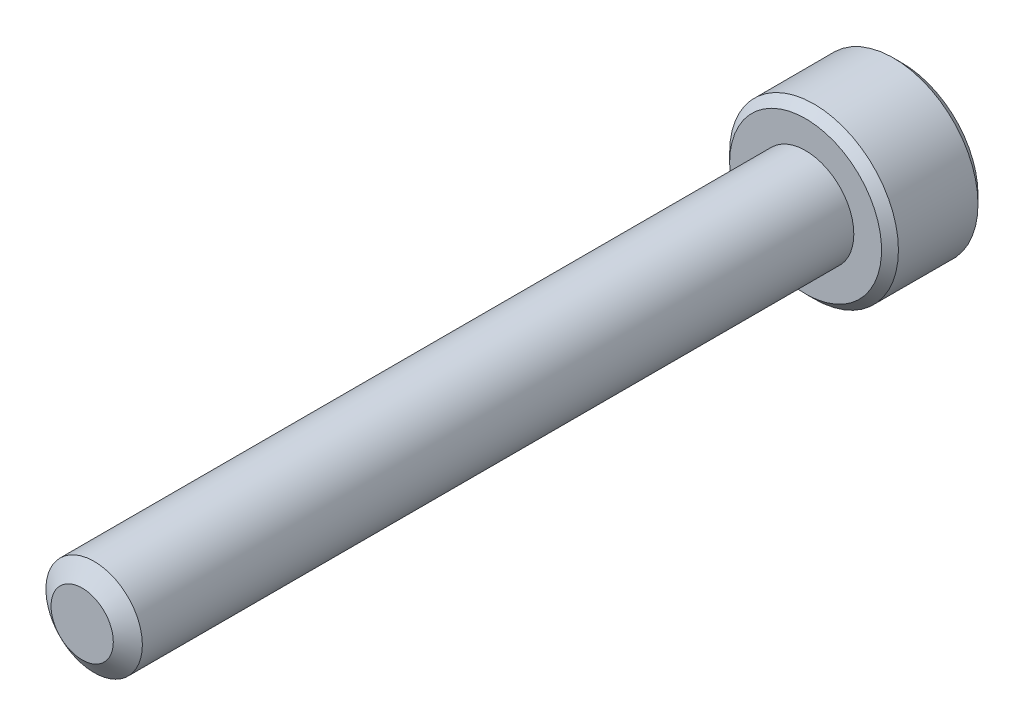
ISO-10303-21;
HEADER;
FILE_DESCRIPTION(('STEP AP214'),'2;1');
FILE_NAME('part.step','',(''),(''),'','','');
FILE_SCHEMA(('AUTOMOTIVE_DESIGN { 1 0 10303 214 1 1 1 1 }'));
ENDSEC;
DATA;
#1=APPLICATION_CONTEXT('core data for automotive mechanical design processes');
#2=APPLICATION_PROTOCOL_DEFINITION('international standard','automotive_design',2000,#1);
#3=PRODUCT_CONTEXT('',#1,'mechanical');
#4=PRODUCT('Part','Part','',(#3));
#5=PRODUCT_RELATED_PRODUCT_CATEGORY('part','',(#4));
#6=PRODUCT_DEFINITION_FORMATION('','',#4);
#7=PRODUCT_DEFINITION_CONTEXT('part definition',#1,'design');
#8=PRODUCT_DEFINITION('design','',#6,#7);
#9=PRODUCT_DEFINITION_SHAPE('','',#8);
#10=(LENGTH_UNIT() NAMED_UNIT(*) SI_UNIT(.MILLI.,.METRE.));
#11=(NAMED_UNIT(*) PLANE_ANGLE_UNIT() SI_UNIT($,.RADIAN.));
#12=(NAMED_UNIT(*) SI_UNIT($,.STERADIAN.) SOLID_ANGLE_UNIT());
#13=UNCERTAINTY_MEASURE_WITH_UNIT(LENGTH_MEASURE(1.E-05),#10,'distance_accuracy_value','');
#14=(GEOMETRIC_REPRESENTATION_CONTEXT(3) GLOBAL_UNCERTAINTY_ASSIGNED_CONTEXT((#13)) GLOBAL_UNIT_ASSIGNED_CONTEXT((#10,
#11,#12)) REPRESENTATION_CONTEXT('',''));
#15=CARTESIAN_POINT('',(0.,0.,0.));
#16=DIRECTION('',(0.,0.,1.));
#17=DIRECTION('',(1.,0.,0.));
#18=AXIS2_PLACEMENT_3D('',#15,#16,#17);
#19=CARTESIAN_POINT('',(0.,0.,-30.));
#20=DIRECTION('',(0.,0.,0.999999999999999));
#21=DIRECTION('',(1.,0.,0.));
#22=AXIS2_PLACEMENT_3D('',#19,#20,#21);
#23=CYLINDRICAL_SURFACE('',#22,2.);
#24=CARTESIAN_POINT('',(0.,0.,-0.496211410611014));
#25=DIRECTION('',(0.,0.,0.999999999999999));
#26=DIRECTION('',(1.,0.,0.));
#27=AXIS2_PLACEMENT_3D('',#24,#25,#26);
#28=CIRCLE('',#27,2.);
#29=CARTESIAN_POINT('',(2.,0.,-0.496211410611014));
#30=VERTEX_POINT('',#29);
#31=EDGE_CURVE('E110',#30,#30,#28,.T.);
#32=CARTESIAN_POINT('',(0.,0.,-30.));
#33=DIRECTION('',(0.,0.,-0.999999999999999));
#34=DIRECTION('',(-1.,0.,0.));
#35=AXIS2_PLACEMENT_3D('',#32,#33,#34);
#36=CIRCLE('',#35,2.);
#37=CARTESIAN_POINT('',(2.,0.,-30.));
#38=VERTEX_POINT('',#37);
#39=EDGE_CURVE('E213',#38,#38,#36,.F.);
#40=CARTESIAN_POINT('',(2.,0.,-0.496211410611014));
#41=CARTESIAN_POINT('',(2.,0.,-0.803542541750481));
#42=CARTESIAN_POINT('',(2.,0.,-1.11087367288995));
#43=CARTESIAN_POINT('',(2.,0.,-1.72553593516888));
#44=CARTESIAN_POINT('',(2.,0.,-2.03286706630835));
#45=CARTESIAN_POINT('',(2.,0.,-2.64752932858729));
#46=CARTESIAN_POINT('',(2.,0.,-2.95486045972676));
#47=CARTESIAN_POINT('',(2.,0.,-3.56952272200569));
#48=CARTESIAN_POINT('',(2.,0.,-3.87685385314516));
#49=CARTESIAN_POINT('',(2.,0.,-4.4915161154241));
#50=CARTESIAN_POINT('',(2.,0.,-4.79884724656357));
#51=CARTESIAN_POINT('',(2.,0.,-5.41350950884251));
#52=CARTESIAN_POINT('',(2.,0.,-5.72084063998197));
#53=CARTESIAN_POINT('',(2.,0.,-6.33550290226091));
#54=CARTESIAN_POINT('',(2.,0.,-6.64283403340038));
#55=CARTESIAN_POINT('',(2.,0.,-7.25749629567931));
#56=CARTESIAN_POINT('',(2.,0.,-7.56482742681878));
#57=CARTESIAN_POINT('',(2.,0.,-8.17948968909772));
#58=CARTESIAN_POINT('',(2.,0.,-8.48682082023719));
#59=CARTESIAN_POINT('',(2.,0.,-9.10148308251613));
#60=CARTESIAN_POINT('',(2.,0.,-9.40881421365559));
#61=CARTESIAN_POINT('',(2.,0.,-10.0234764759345));
#62=CARTESIAN_POINT('',(2.,0.,-10.330807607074));
#63=CARTESIAN_POINT('',(2.,0.,-10.9454698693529));
#64=CARTESIAN_POINT('',(2.,0.,-11.2528010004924));
#65=CARTESIAN_POINT('',(2.,0.,-11.8674632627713));
#66=CARTESIAN_POINT('',(2.,0.,-12.1747943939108));
#67=CARTESIAN_POINT('',(2.,0.,-12.7894566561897));
#68=CARTESIAN_POINT('',(2.,0.,-13.0967877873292));
#69=CARTESIAN_POINT('',(2.,0.,-13.7114500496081));
#70=CARTESIAN_POINT('',(2.,0.,-14.0187811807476));
#71=CARTESIAN_POINT('',(2.,0.,-14.6334434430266));
#72=CARTESIAN_POINT('',(2.,0.,-14.940774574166));
#73=CARTESIAN_POINT('',(2.,0.,-15.555436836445));
#74=CARTESIAN_POINT('',(2.,0.,-15.8627679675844));
#75=CARTESIAN_POINT('',(2.,0.,-16.4774302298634));
#76=CARTESIAN_POINT('',(2.,0.,-16.7847613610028));
#77=CARTESIAN_POINT('',(2.,0.,-17.3994236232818));
#78=CARTESIAN_POINT('',(2.,0.,-17.7067547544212));
#79=CARTESIAN_POINT('',(2.,0.,-18.3214170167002));
#80=CARTESIAN_POINT('',(2.,0.,-18.6287481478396));
#81=CARTESIAN_POINT('',(2.,0.,-19.2434104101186));
#82=CARTESIAN_POINT('',(2.,0.,-19.550741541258));
#83=CARTESIAN_POINT('',(2.,0.,-20.165403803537));
#84=CARTESIAN_POINT('',(2.,0.,-20.4727349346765));
#85=CARTESIAN_POINT('',(2.,0.,-21.0873971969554));
#86=CARTESIAN_POINT('',(2.,0.,-21.3947283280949));
#87=CARTESIAN_POINT('',(2.,0.,-22.0093905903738));
#88=CARTESIAN_POINT('',(2.,0.,-22.3167217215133));
#89=CARTESIAN_POINT('',(2.,0.,-22.9313839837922));
#90=CARTESIAN_POINT('',(2.,0.,-23.2387151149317));
#91=CARTESIAN_POINT('',(2.,0.,-23.8533773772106));
#92=CARTESIAN_POINT('',(2.,0.,-24.1607085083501));
#93=CARTESIAN_POINT('',(2.,0.,-24.775370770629));
#94=CARTESIAN_POINT('',(2.,0.,-25.0827019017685));
#95=CARTESIAN_POINT('',(2.,0.,-25.6973641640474));
#96=CARTESIAN_POINT('',(2.,0.,-26.0046952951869));
#97=CARTESIAN_POINT('',(2.,0.,-26.6193575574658));
#98=CARTESIAN_POINT('',(2.,0.,-26.9266886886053));
#99=CARTESIAN_POINT('',(2.,0.,-27.5413509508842));
#100=CARTESIAN_POINT('',(2.,0.,-27.8486820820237));
#101=CARTESIAN_POINT('',(2.,0.,-28.4633443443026));
#102=CARTESIAN_POINT('',(2.,0.,-28.7706754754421));
#103=CARTESIAN_POINT('',(2.,0.,-29.385337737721));
#104=CARTESIAN_POINT('',(2.,0.,-29.6926688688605));
#105=CARTESIAN_POINT('',(2.,0.,-30.));
#106=B_SPLINE_CURVE_WITH_KNOTS('',3,(#40,#41,#42,#43,#44,#45,#46,#47,#48,#49,#50,#51,#52,#53,
#54,#55,#56,#57,#58,#59,#60,#61,#62,#63,#64,#65,#66,#67,#68,#69,#70,#71,#72,#73,#74,#75,#76,#77,
#78,#79,#80,#81,#82,#83,#84,#85,#86,#87,#88,#89,#90,#91,#92,#93,#94,#95,#96,#97,#98,#99,#100,
#101,#102,#103,#104,#105),.UNSPECIFIED.,.F.,.F.,(4,2,2,2,2,2,2,2,2,2,2,2,2,2,2,2,2,2,2,2,2,2,2,
2,2,2,2,2,2,2,2,2,4),(0.,0.921993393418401,1.84398678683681,2.76598018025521,3.68797357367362,
4.60996696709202,5.53196036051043,6.45395375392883,7.37594714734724,8.29794054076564,
9.21993393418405,10.1419273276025,11.0639207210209,11.9859141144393,12.9079075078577,
13.8299009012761,14.7518942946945,15.6738876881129,16.5958810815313,17.5178744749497,
18.4398678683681,19.3618612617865,20.2838546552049,21.2058480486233,22.1278414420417,
23.0498348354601,23.9718282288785,24.8938216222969,25.8158150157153,26.7378084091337,
27.6598018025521,28.5817951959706,29.503788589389),.UNSPECIFIED.);
#107=EDGE_CURVE('BSEAM36',#30,#38,#106,.T.);
#108=ORIENTED_EDGE('',*,*,#31,.F.);
#109=ORIENTED_EDGE('',*,*,#39,.T.);
#110=ORIENTED_EDGE('',*,*,#107,.T.);
#111=ORIENTED_EDGE('',*,*,#107,.F.);
#112=EDGE_LOOP('',(#108,#110,#109,#111));
#113=FACE_BOUND('',#112,.T.);
#114=ADVANCED_FACE('F36',(#113),#23,.T.);
#115=CARTESIAN_POINT('',(0.,0.,0.));
#116=DIRECTION('',(0.,0.,-0.999999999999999));
#117=DIRECTION('',(-1.,0.,0.));
#118=AXIS2_PLACEMENT_3D('',#115,#116,#117);
#119=CONICAL_SURFACE('',#118,1.29133666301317,0.959931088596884);
#120=ORIENTED_EDGE('',*,*,#31,.T.);
#121=EDGE_LOOP('',(#120));
#122=FACE_BOUND('',#121,.T.);
#123=CARTESIAN_POINT('',(0.,0.,0.));
#124=DIRECTION('',(0.,0.,0.999999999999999));
#125=DIRECTION('',(1.,0.,0.));
#126=AXIS2_PLACEMENT_3D('',#123,#124,#125);
#127=CIRCLE('',#126,1.29133666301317);
#128=CARTESIAN_POINT('',(1.29133666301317,0.,0.));
#129=VERTEX_POINT('',#128);
#130=EDGE_CURVE('E211',#129,#129,#127,.T.);
#131=ORIENTED_EDGE('',*,*,#130,.F.);
#132=EDGE_LOOP('',(#131));
#133=FACE_BOUND('',#132,.T.);
#134=ADVANCED_FACE('F194',(#122,#133),#119,.T.);
#135=CARTESIAN_POINT('',(0.,0.,0.));
#136=DIRECTION('',(0.,0.,0.999999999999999));
#137=DIRECTION('',(1.,0.,0.));
#138=AXIS2_PLACEMENT_3D('',#135,#136,#137);
#139=PLANE('',#138);
#140=ORIENTED_EDGE('',*,*,#130,.T.);
#141=EDGE_LOOP('',(#140));
#142=FACE_BOUND('',#141,.T.);
#143=ADVANCED_FACE('F191',(#142),#139,.T.);
#144=CARTESIAN_POINT('',(0.,0.,-34.));
#145=DIRECTION('',(0.,0.,0.999999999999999));
#146=DIRECTION('',(1.,0.,0.));
#147=AXIS2_PLACEMENT_3D('',#144,#145,#146);
#148=CYLINDRICAL_SURFACE('',#147,3.5);
#149=CARTESIAN_POINT('',(0.,0.,-33.65));
#150=DIRECTION('',(0.,0.,-0.999999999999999));
#151=DIRECTION('',(-1.,0.,0.));
#152=AXIS2_PLACEMENT_3D('',#149,#150,#151);
#153=CIRCLE('',#152,3.5);
#154=CARTESIAN_POINT('',(3.5,0.,-33.65));
#155=VERTEX_POINT('',#154);
#156=EDGE_CURVE('E44',#155,#155,#153,.F.);
#157=CARTESIAN_POINT('',(0.,0.,-30.35));
#158=DIRECTION('',(0.,0.,-0.999999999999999));
#159=DIRECTION('',(-1.,0.,0.));
#160=AXIS2_PLACEMENT_3D('',#157,#158,#159);
#161=CIRCLE('',#160,3.5);
#162=CARTESIAN_POINT('',(3.5,0.,-30.35));
#163=VERTEX_POINT('',#162);
#164=EDGE_CURVE('E170',#163,#163,#161,.T.);
#165=CARTESIAN_POINT('',(3.5,0.,-33.65));
#166=CARTESIAN_POINT('',(3.5,0.,-33.615625));
#167=CARTESIAN_POINT('',(3.5,0.,-33.58125));
#168=CARTESIAN_POINT('',(3.5,0.,-33.5125));
#169=CARTESIAN_POINT('',(3.5,0.,-33.478125));
#170=CARTESIAN_POINT('',(3.5,0.,-33.409375));
#171=CARTESIAN_POINT('',(3.5,0.,-33.375));
#172=CARTESIAN_POINT('',(3.5,0.,-33.30625));
#173=CARTESIAN_POINT('',(3.5,0.,-33.271875));
#174=CARTESIAN_POINT('',(3.5,0.,-33.203125));
#175=CARTESIAN_POINT('',(3.5,0.,-33.16875));
#176=CARTESIAN_POINT('',(3.5,0.,-33.1));
#177=CARTESIAN_POINT('',(3.5,0.,-33.065625));
#178=CARTESIAN_POINT('',(3.5,0.,-32.996875));
#179=CARTESIAN_POINT('',(3.5,0.,-32.9625));
#180=CARTESIAN_POINT('',(3.5,0.,-32.89375));
#181=CARTESIAN_POINT('',(3.5,0.,-32.859375));
#182=CARTESIAN_POINT('',(3.5,0.,-32.790625));
#183=CARTESIAN_POINT('',(3.5,0.,-32.75625));
#184=CARTESIAN_POINT('',(3.5,0.,-32.6875));
#185=CARTESIAN_POINT('',(3.5,0.,-32.653125));
#186=CARTESIAN_POINT('',(3.5,0.,-32.584375));
#187=CARTESIAN_POINT('',(3.5,0.,-32.55));
#188=CARTESIAN_POINT('',(3.5,0.,-32.48125));
#189=CARTESIAN_POINT('',(3.5,0.,-32.446875));
#190=CARTESIAN_POINT('',(3.5,0.,-32.378125));
#191=CARTESIAN_POINT('',(3.5,0.,-32.34375));
#192=CARTESIAN_POINT('',(3.5,0.,-32.275));
#193=CARTESIAN_POINT('',(3.5,0.,-32.240625));
#194=CARTESIAN_POINT('',(3.5,0.,-32.171875));
#195=CARTESIAN_POINT('',(3.5,0.,-32.1375));
#196=CARTESIAN_POINT('',(3.5,0.,-32.06875));
#197=CARTESIAN_POINT('',(3.5,0.,-32.034375));
#198=CARTESIAN_POINT('',(3.5,0.,-31.965625));
#199=CARTESIAN_POINT('',(3.5,0.,-31.93125));
#200=CARTESIAN_POINT('',(3.5,0.,-31.8625));
#201=CARTESIAN_POINT('',(3.5,0.,-31.828125));
#202=CARTESIAN_POINT('',(3.5,0.,-31.759375));
#203=CARTESIAN_POINT('',(3.5,0.,-31.725));
#204=CARTESIAN_POINT('',(3.5,0.,-31.65625));
#205=CARTESIAN_POINT('',(3.5,0.,-31.621875));
#206=CARTESIAN_POINT('',(3.5,0.,-31.553125));
#207=CARTESIAN_POINT('',(3.5,0.,-31.51875));
#208=CARTESIAN_POINT('',(3.5,0.,-31.45));
#209=CARTESIAN_POINT('',(3.5,0.,-31.415625));
#210=CARTESIAN_POINT('',(3.5,0.,-31.346875));
#211=CARTESIAN_POINT('',(3.5,0.,-31.3125));
#212=CARTESIAN_POINT('',(3.5,0.,-31.24375));
#213=CARTESIAN_POINT('',(3.5,0.,-31.209375));
#214=CARTESIAN_POINT('',(3.5,0.,-31.140625));
#215=CARTESIAN_POINT('',(3.5,0.,-31.10625));
#216=CARTESIAN_POINT('',(3.5,0.,-31.0375));
#217=CARTESIAN_POINT('',(3.5,0.,-31.003125));
#218=CARTESIAN_POINT('',(3.5,0.,-30.934375));
#219=CARTESIAN_POINT('',(3.5,0.,-30.9));
#220=CARTESIAN_POINT('',(3.5,0.,-30.83125));
#221=CARTESIAN_POINT('',(3.5,0.,-30.796875));
#222=CARTESIAN_POINT('',(3.5,0.,-30.728125));
#223=CARTESIAN_POINT('',(3.5,0.,-30.69375));
#224=CARTESIAN_POINT('',(3.5,0.,-30.625));
#225=CARTESIAN_POINT('',(3.5,0.,-30.590625));
#226=CARTESIAN_POINT('',(3.5,0.,-30.521875));
#227=CARTESIAN_POINT('',(3.5,0.,-30.4875));
#228=CARTESIAN_POINT('',(3.5,0.,-30.41875));
#229=CARTESIAN_POINT('',(3.5,0.,-30.384375));
#230=CARTESIAN_POINT('',(3.5,0.,-30.35));
#231=B_SPLINE_CURVE_WITH_KNOTS('',3,(#165,#166,#167,#168,#169,#170,#171,#172,#173,#174,#175,
#176,#177,#178,#179,#180,#181,#182,#183,#184,#185,#186,#187,#188,#189,#190,#191,#192,#193,#194,
#195,#196,#197,#198,#199,#200,#201,#202,#203,#204,#205,#206,#207,#208,#209,#210,#211,#212,#213,
#214,#215,#216,#217,#218,#219,#220,#221,#222,#223,#224,#225,#226,#227,#228,#229,#230),
.UNSPECIFIED.,.F.,.F.,(4,2,2,2,2,2,2,2,2,2,2,2,2,2,2,2,2,2,2,2,2,2,2,2,2,2,2,2,2,2,2,2,4),(0.,
0.103125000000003,0.206250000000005,0.309375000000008,0.412500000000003,0.515625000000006,
0.618750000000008,0.721875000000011,0.825000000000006,0.928125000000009,1.03125000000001,
1.13437500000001,1.23750000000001,1.34062500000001,1.44375000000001,1.54687500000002,
1.65000000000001,1.75312500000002,1.85625000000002,1.95937500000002,2.06250000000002,
2.16562500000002,2.26875000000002,2.37187500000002,2.47500000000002,2.57812500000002,
2.68125000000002,2.78437500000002,2.88750000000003,2.99062500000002,3.09375000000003,
3.19687500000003,3.30000000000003),.UNSPECIFIED.);
#232=EDGE_CURVE('BSEAM175',#155,#163,#231,.T.);
#233=ORIENTED_EDGE('',*,*,#156,.T.);
#234=ORIENTED_EDGE('',*,*,#164,.T.);
#235=ORIENTED_EDGE('',*,*,#232,.T.);
#236=ORIENTED_EDGE('',*,*,#232,.F.);
#237=EDGE_LOOP('',(#233,#235,#234,#236));
#238=FACE_BOUND('',#237,.T.);
#239=ADVANCED_FACE('F175',(#238),#148,.T.);
#240=CARTESIAN_POINT('',(0.,0.,-34.));
#241=DIRECTION('',(0.,0.,-0.999999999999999));
#242=DIRECTION('',(-1.,0.,0.));
#243=AXIS2_PLACEMENT_3D('',#240,#241,#242);
#244=PLANE('',#243);
#245=CARTESIAN_POINT('',(0.,0.,-34.));
#246=DIRECTION('',(0.,0.,-0.999999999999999));
#247=DIRECTION('',(-1.,0.,0.));
#248=AXIS2_PLACEMENT_3D('',#245,#246,#247);
#249=CIRCLE('',#248,3.15);
#250=CARTESIAN_POINT('',(3.15,0.,-34.));
#251=VERTEX_POINT('',#250);
#252=EDGE_CURVE('E109',#251,#251,#249,.T.);
#253=ORIENTED_EDGE('',*,*,#252,.T.);
#254=EDGE_LOOP('',(#253));
#255=FACE_BOUND('',#254,.T.);
#256=CARTESIAN_POINT('',(0.,0.,-34.));
#257=DIRECTION('',(0.,0.,-0.999999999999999));
#258=DIRECTION('',(-1.,0.,0.));
#259=AXIS2_PLACEMENT_3D('',#256,#257,#258);
#260=CIRCLE('',#259,1.73205080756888);
#261=CARTESIAN_POINT('',(-1.49999999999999,0.866025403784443,-34.));
#262=VERTEX_POINT('',#261);
#263=CARTESIAN_POINT('',(0.,1.73205080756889,-34.));
#264=VERTEX_POINT('',#263);
#265=EDGE_CURVE('E90',#262,#264,#260,.T.);
#266=ORIENTED_EDGE('',*,*,#265,.F.);
#267=CARTESIAN_POINT('',(-1.50000000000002,-0.866025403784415,-34.));
#268=VERTEX_POINT('',#267);
#269=EDGE_CURVE('E50',#268,#262,#260,.T.);
#270=ORIENTED_EDGE('',*,*,#269,.F.);
#271=CARTESIAN_POINT('',(0.,-1.7320508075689,-34.));
#272=VERTEX_POINT('',#271);
#273=EDGE_CURVE('E270',#272,#268,#260,.T.);
#274=ORIENTED_EDGE('',*,*,#273,.F.);
#275=CARTESIAN_POINT('',(1.5,-0.866025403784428,-34.));
#276=VERTEX_POINT('',#275);
#277=EDGE_CURVE('E57',#276,#272,#260,.T.);
#278=ORIENTED_EDGE('',*,*,#277,.F.);
#279=CARTESIAN_POINT('',(1.5,0.866025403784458,-34.));
#280=VERTEX_POINT('',#279);
#281=EDGE_CURVE('E131',#280,#276,#260,.T.);
#282=ORIENTED_EDGE('',*,*,#281,.F.);
#283=EDGE_CURVE('E99',#264,#280,#260,.T.);
#284=ORIENTED_EDGE('',*,*,#283,.F.);
#285=EDGE_LOOP('',(#266,#270,#274,#278,#282,#284));
#286=FACE_BOUND('',#285,.T.);
#287=ADVANCED_FACE('F130',(#255,#286),#244,.T.);
#288=CARTESIAN_POINT('',(0.,0.,-30.));
#289=DIRECTION('',(0.,0.,-0.999999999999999));
#290=DIRECTION('',(-1.,0.,0.));
#291=AXIS2_PLACEMENT_3D('',#288,#289,#290);
#292=PLANE('',#291);
#293=CARTESIAN_POINT('',(0.,0.,-30.));
#294=DIRECTION('',(0.,0.,-0.999999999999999));
#295=DIRECTION('',(-1.,0.,0.));
#296=AXIS2_PLACEMENT_3D('',#293,#294,#295);
#297=CIRCLE('',#296,3.14999999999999);
#298=CARTESIAN_POINT('',(-3.15,0.,-30.));
#299=VERTEX_POINT('',#298);
#300=EDGE_CURVE('E11',#299,#299,#297,.F.);
#301=ORIENTED_EDGE('',*,*,#300,.T.);
#302=EDGE_LOOP('',(#301));
#303=FACE_BOUND('',#302,.T.);
#304=ORIENTED_EDGE('',*,*,#39,.F.);
#305=EDGE_LOOP('',(#304));
#306=FACE_BOUND('',#305,.T.);
#307=ADVANCED_FACE('F184',(#303,#306),#292,.F.);
#308=CARTESIAN_POINT('',(0.,0.,-34.));
#309=DIRECTION('',(0.,0.,-0.999999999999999));
#310=DIRECTION('',(-1.,0.,0.));
#311=AXIS2_PLACEMENT_3D('',#308,#309,#310);
#312=CONICAL_SURFACE('',#311,1.73205080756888,0.78539816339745);
#313=ORIENTED_EDGE('',*,*,#283,.T.);
#314=CARTESIAN_POINT('',(-0.000200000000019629,1.73216627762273,-34.0001154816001));
#315=CARTESIAN_POINT('',(0.0513677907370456,1.70239359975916,-33.9703654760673));
#316=CARTESIAN_POINT('',(0.103797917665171,1.67212305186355,-33.9423624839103));
#317=CARTESIAN_POINT('',(0.210709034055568,1.61039789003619,-33.8910892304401));
#318=CARTESIAN_POINT('',(0.265200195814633,1.57893740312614,-33.8678475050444));
#319=CARTESIAN_POINT('',(0.375079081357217,1.51549879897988,-33.8280337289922));
#320=CARTESIAN_POINT('',(0.430438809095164,1.4835368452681,-33.8113615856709));
#321=CARTESIAN_POINT('',(0.542377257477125,1.41890915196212,-33.7856744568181));
#322=CARTESIAN_POINT('',(0.598952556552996,1.38624538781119,-33.7766402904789));
#323=CARTESIAN_POINT('',(0.696455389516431,1.329952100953,-33.7684890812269));
#324=CARTESIAN_POINT('',(0.737256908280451,1.30639533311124,-33.7672822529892));
#325=CARTESIAN_POINT('',(0.818787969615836,1.25932335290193,-33.7693140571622));
#326=CARTESIAN_POINT('',(0.859517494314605,1.23580815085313,-33.7725536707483));
#327=CARTESIAN_POINT('',(0.94058440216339,1.18900414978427,-33.7832919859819));
#328=CARTESIAN_POINT('',(0.980921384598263,1.1657155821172,-33.7907946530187));
#329=CARTESIAN_POINT('',(1.060918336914,1.11952932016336,-33.8096516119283));
#330=CARTESIAN_POINT('',(1.10057800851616,1.09663179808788,-33.8210075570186));
#331=CARTESIAN_POINT('',(1.20216313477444,1.037981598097,-33.8547216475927));
#332=CARTESIAN_POINT('',(1.26345855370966,1.00259267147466,-33.8796218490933));
#333=CARTESIAN_POINT('',(1.3535856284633,0.950557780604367,-33.9216566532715));
#334=CARTESIAN_POINT('',(1.3832851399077,0.933410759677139,-33.936425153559));
#335=CARTESIAN_POINT('',(1.44213790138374,0.899432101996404,-33.9673105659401));
#336=CARTESIAN_POINT('',(1.47129140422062,0.882600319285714,-33.9834268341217));
#337=CARTESIAN_POINT('',(1.50019999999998,0.86590993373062,-34.0001154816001));
#338=B_SPLINE_CURVE_WITH_KNOTS('',3,(#314,#315,#316,#317,#318,#319,#320,#321,#322,#323,#324,
#325,#326,#327,#328,#329,#330,#331,#332,#333,#334,#335,#336,#337),.UNSPECIFIED.,.F.,.F.,(4,2,2,
2,2,2,2,2,2,2,2,4),(0.,0.199829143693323,0.400822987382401,0.598623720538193,0.795926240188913,
0.937113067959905,1.07833105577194,1.21968061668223,1.36109089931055,1.58570969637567,
1.69770705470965,1.80965120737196),.UNSPECIFIED.);
#339=EDGE_CURVE('E104',#264,#280,#338,.T.);
#340=ORIENTED_EDGE('',*,*,#339,.F.);
#341=EDGE_LOOP('',(#313,#340));
#342=FACE_BOUND('',#341,.T.);
#343=ADVANCED_FACE('F105',(#342),#312,.F.);
#344=ORIENTED_EDGE('',*,*,#281,.T.);
#345=CARTESIAN_POINT('',(1.50000000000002,-1.72720812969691,-34.5555785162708));
#346=CARTESIAN_POINT('',(1.50000000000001,-1.68515175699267,-34.5238299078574));
#347=CARTESIAN_POINT('',(1.5,-1.64286104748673,-34.4923925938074));
#348=CARTESIAN_POINT('',(1.5,-1.55771581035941,-34.4302690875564));
#349=CARTESIAN_POINT('',(1.5,-1.51486114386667,-34.3995830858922));
#350=CARTESIAN_POINT('',(1.5,-1.38468134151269,-34.3084071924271));
#351=CARTESIAN_POINT('',(1.5,-1.29637976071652,-34.2492883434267));
#352=CARTESIAN_POINT('',(1.5,-1.11121478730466,-34.1332309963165));
#353=CARTESIAN_POINT('',(1.49999999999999,-1.01415038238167,-34.076609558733));
#354=CARTESIAN_POINT('',(1.50000000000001,-0.815173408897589,-33.9730368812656));
#355=CARTESIAN_POINT('',(1.50000000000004,-0.713278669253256,-33.9260530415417));
#356=CARTESIAN_POINT('',(1.50000000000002,-0.560333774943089,-33.8685726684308));
#357=CARTESIAN_POINT('',(1.50000000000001,-0.511547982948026,-33.8520753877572));
#358=CARTESIAN_POINT('',(1.5,-0.412798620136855,-33.822997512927));
#359=CARTESIAN_POINT('',(1.5,-0.36283496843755,-33.810417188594));
#360=CARTESIAN_POINT('',(1.5,-0.26286323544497,-33.7900361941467));
#361=CARTESIAN_POINT('',(1.5,-0.212872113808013,-33.7821536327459));
#362=CARTESIAN_POINT('',(1.5,-0.112355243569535,-33.771322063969));
#363=CARTESIAN_POINT('',(1.5,-0.0618295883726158,-33.7683722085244));
#364=CARTESIAN_POINT('',(1.5,0.0374291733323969,-33.7676248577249));
#365=CARTESIAN_POINT('',(1.5,0.0861609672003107,-33.7696447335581));
#366=CARTESIAN_POINT('',(1.5,0.183206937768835,-33.7783225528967));
#367=CARTESIAN_POINT('',(1.5,0.231521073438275,-33.7849809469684));
#368=CARTESIAN_POINT('',(1.5,0.328199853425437,-33.8026852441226));
#369=CARTESIAN_POINT('',(1.5,0.376550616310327,-33.813805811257));
#370=CARTESIAN_POINT('',(1.5,0.472195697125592,-33.8398434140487));
#371=CARTESIAN_POINT('',(1.5,0.519490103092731,-33.8547601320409));
#372=CARTESIAN_POINT('',(1.5,0.668391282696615,-33.9073352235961));
#373=CARTESIAN_POINT('',(1.5,0.767878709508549,-33.950981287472));
#374=CARTESIAN_POINT('',(1.5,0.962179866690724,-34.0480229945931));
#375=CARTESIAN_POINT('',(1.5,1.05697519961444,-34.1014536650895));
#376=CARTESIAN_POINT('',(1.5,1.23814273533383,-34.2116858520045));
#377=CARTESIAN_POINT('',(1.5,1.3246994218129,-34.2681879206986));
#378=CARTESIAN_POINT('',(1.5,1.45222331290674,-34.3555343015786));
#379=CARTESIAN_POINT('',(1.5,1.49418091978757,-34.38495775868));
#380=CARTESIAN_POINT('',(1.5,1.57752272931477,-34.4445828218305));
#381=CARTESIAN_POINT('',(1.50000000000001,1.61890708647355,-34.4747842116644));
#382=CARTESIAN_POINT('',(1.50000000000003,1.66005278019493,-34.5053081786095));
#383=B_SPLINE_CURVE_WITH_KNOTS('',3,(#345,#346,#347,#348,#349,#350,#351,#352,#353,#354,#355,
#356,#357,#358,#359,#360,#361,#362,#363,#364,#365,#366,#367,#368,#369,#370,#371,#372,#373,#374,
#375,#376,#377,#378,#379,#380,#381,#382),.UNSPECIFIED.,.F.,.F.,(4,2,2,2,2,2,2,2,2,2,2,2,2,2,2,2,
2,2,4),(0.,0.158079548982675,0.316198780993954,0.63485041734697,0.97169031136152,
1.30737131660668,1.4617396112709,1.61611853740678,1.7677210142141,1.91929742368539,
2.06538741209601,2.21149159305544,2.36014984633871,2.50879566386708,2.83376031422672,
3.15991186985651,3.46985601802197,3.62358896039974,3.77727962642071),.UNSPECIFIED.);
#384=EDGE_CURVE('E98',#280,#276,#383,.F.);
#385=ORIENTED_EDGE('',*,*,#384,.F.);
#386=EDGE_LOOP('',(#344,#385));
#387=FACE_BOUND('',#386,.T.);
#388=ADVANCED_FACE('F276',(#387),#312,.F.);
#389=ORIENTED_EDGE('',*,*,#277,.T.);
#390=CARTESIAN_POINT('',(1.50020000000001,-0.865909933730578,-34.0001154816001));
#391=CARTESIAN_POINT('',(1.44863220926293,-0.895682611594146,-33.9703654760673));
#392=CARTESIAN_POINT('',(1.39620208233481,-0.925953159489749,-33.9423624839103));
#393=CARTESIAN_POINT('',(1.28929096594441,-0.987678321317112,-33.8910892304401));
#394=CARTESIAN_POINT('',(1.23479980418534,-1.01913880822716,-33.8678475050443));
#395=CARTESIAN_POINT('',(1.12492091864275,-1.08257741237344,-33.8280337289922));
#396=CARTESIAN_POINT('',(1.0695611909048,-1.11453936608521,-33.8113615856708));
#397=CARTESIAN_POINT('',(0.957622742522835,-1.1791670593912,-33.7856744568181));
#398=CARTESIAN_POINT('',(0.901047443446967,-1.21183082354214,-33.7766402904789));
#399=CARTESIAN_POINT('',(0.803544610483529,-1.26812411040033,-33.7684890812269));
#400=CARTESIAN_POINT('',(0.762743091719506,-1.29168087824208,-33.7672822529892));
#401=CARTESIAN_POINT('',(0.681212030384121,-1.33875285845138,-33.7693140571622));
#402=CARTESIAN_POINT('',(0.640482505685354,-1.36226806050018,-33.7725536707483));
#403=CARTESIAN_POINT('',(0.559415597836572,-1.40907206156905,-33.7832919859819));
#404=CARTESIAN_POINT('',(0.519078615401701,-1.43236062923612,-33.7907946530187));
#405=CARTESIAN_POINT('',(0.43908166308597,-1.47854689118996,-33.8096516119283));
#406=CARTESIAN_POINT('',(0.399421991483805,-1.50144441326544,-33.8210075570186));
#407=CARTESIAN_POINT('',(0.297836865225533,-1.56009461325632,-33.8547216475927));
#408=CARTESIAN_POINT('',(0.23654144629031,-1.59548353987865,-33.8796218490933));
#409=CARTESIAN_POINT('',(0.146414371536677,-1.64751843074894,-33.9216566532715));
#410=CARTESIAN_POINT('',(0.116714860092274,-1.66466545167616,-33.9364251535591));
#411=CARTESIAN_POINT('',(0.0578620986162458,-1.6986441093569,-33.9673105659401));
#412=CARTESIAN_POINT('',(0.0287085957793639,-1.71547589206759,-33.9834268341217));
#413=CARTESIAN_POINT('',(-0.000199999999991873,-1.7321662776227,-34.0001154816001));
#414=B_SPLINE_CURVE_WITH_KNOTS('',3,(#390,#391,#392,#393,#394,#395,#396,#397,#398,#399,#400,
#401,#402,#403,#404,#405,#406,#407,#408,#409,#410,#411,#412,#413),.UNSPECIFIED.,.F.,.F.,(4,2,2,
2,2,2,2,2,2,2,2,4),(0.,0.199829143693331,0.40082298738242,0.59862372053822,0.795926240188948,
0.937113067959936,1.07833105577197,1.21968061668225,1.36109089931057,1.58570969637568,
1.69770705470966,1.80965120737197),.UNSPECIFIED.);
#415=EDGE_CURVE('E140',#276,#272,#414,.T.);
#416=ORIENTED_EDGE('',*,*,#415,.F.);
#417=EDGE_LOOP('',(#389,#416));
#418=FACE_BOUND('',#417,.T.);
#419=ADVANCED_FACE('F273',(#418),#312,.F.);
#420=ORIENTED_EDGE('',*,*,#273,.T.);
#421=CARTESIAN_POINT('',(0.000199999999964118,-1.73216627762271,-34.0001154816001));
#422=CARTESIAN_POINT('',(-0.0513677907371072,-1.70239359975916,-33.9703654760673));
#423=CARTESIAN_POINT('',(-0.10379791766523,-1.67212305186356,-33.9423624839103));
#424=CARTESIAN_POINT('',(-0.210709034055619,-1.6103978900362,-33.8910892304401));
#425=CARTESIAN_POINT('',(-0.26520019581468,-1.57893740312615,-33.8678475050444));
#426=CARTESIAN_POINT('',(-0.375079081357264,-1.51549879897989,-33.8280337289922));
#427=CARTESIAN_POINT('',(-0.430438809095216,-1.48353684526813,-33.8113615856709));
#428=CARTESIAN_POINT('',(-0.542377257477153,-1.41890915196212,-33.7856744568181));
#429=CARTESIAN_POINT('',(-0.598952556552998,-1.38624538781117,-33.7766402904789));
#430=CARTESIAN_POINT('',(-0.696455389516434,-1.32995210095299,-33.7684890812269));
#431=CARTESIAN_POINT('',(-0.73725690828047,-1.30639533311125,-33.7672822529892));
#432=CARTESIAN_POINT('',(-0.818787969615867,-1.25932335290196,-33.7693140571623));
#433=CARTESIAN_POINT('',(-0.859517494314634,-1.23580815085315,-33.7725536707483));
#434=CARTESIAN_POINT('',(-0.94058440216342,-1.18900414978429,-33.783291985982));
#435=CARTESIAN_POINT('',(-0.980921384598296,-1.16571558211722,-33.7907946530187));
#436=CARTESIAN_POINT('',(-1.06091833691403,-1.11952932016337,-33.8096516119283));
#437=CARTESIAN_POINT('',(-1.10057800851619,-1.09663179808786,-33.8210075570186));
#438=CARTESIAN_POINT('',(-1.20216313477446,-1.03798159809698,-33.8547216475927));
#439=CARTESIAN_POINT('',(-1.2634585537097,-1.00259267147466,-33.8796218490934));
#440=CARTESIAN_POINT('',(-1.35358562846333,-0.95055778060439,-33.9216566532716));
#441=CARTESIAN_POINT('',(-1.38328513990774,-0.933410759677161,-33.9364251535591));
#442=CARTESIAN_POINT('',(-1.44213790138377,-0.899432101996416,-33.9673105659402));
#443=CARTESIAN_POINT('',(-1.47129140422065,-0.882600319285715,-33.9834268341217));
#444=CARTESIAN_POINT('',(-1.50020000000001,-0.865909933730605,-34.0001154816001));
#445=B_SPLINE_CURVE_WITH_KNOTS('',3,(#421,#422,#423,#424,#425,#426,#427,#428,#429,#430,#431,
#432,#433,#434,#435,#436,#437,#438,#439,#440,#441,#442,#443,#444),.UNSPECIFIED.,.F.,.F.,(4,2,2,
2,2,2,2,2,2,2,2,4),(0.,0.199829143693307,0.400822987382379,0.598623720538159,0.795926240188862,
0.937113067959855,1.0783310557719,1.21968061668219,1.36109089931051,1.58570969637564,
1.69770705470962,1.80965120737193),.UNSPECIFIED.);
#446=EDGE_CURVE('E248',#272,#268,#445,.T.);
#447=ORIENTED_EDGE('',*,*,#446,.F.);
#448=EDGE_LOOP('',(#420,#447));
#449=FACE_BOUND('',#448,.T.);
#450=ADVANCED_FACE('F272',(#449),#312,.F.);
#451=ORIENTED_EDGE('',*,*,#269,.T.);
#452=CARTESIAN_POINT('',(-1.50000000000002,-1.72720812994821,-34.5555785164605));
#453=CARTESIAN_POINT('',(-1.50000000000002,-1.68515175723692,-34.5238299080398));
#454=CARTESIAN_POINT('',(-1.50000000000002,-1.64286104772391,-34.4923925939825));
#455=CARTESIAN_POINT('',(-1.50000000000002,-1.55771581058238,-34.430269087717));
#456=CARTESIAN_POINT('',(-1.50000000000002,-1.51486114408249,-34.3995830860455));
#457=CARTESIAN_POINT('',(-1.50000000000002,-1.38468134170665,-34.3084071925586));
#458=CARTESIAN_POINT('',(-1.50000000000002,-1.29637976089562,-34.2492883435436));
#459=CARTESIAN_POINT('',(-1.50000000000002,-1.11121478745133,-34.1332309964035));
#460=CARTESIAN_POINT('',(-1.50000000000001,-1.0141503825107,-34.0766095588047));
#461=CARTESIAN_POINT('',(-1.50000000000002,-0.815173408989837,-33.9730368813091));
#462=CARTESIAN_POINT('',(-1.50000000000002,-0.713278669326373,-33.9260530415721));
#463=CARTESIAN_POINT('',(-1.50000000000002,-0.560333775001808,-33.8685726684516));
#464=CARTESIAN_POINT('',(-1.50000000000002,-0.511547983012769,-33.8520753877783));
#465=CARTESIAN_POINT('',(-1.50000000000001,-0.412798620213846,-33.8229975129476));
#466=CARTESIAN_POINT('',(-1.50000000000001,-0.362834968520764,-33.8104171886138));
#467=CARTESIAN_POINT('',(-1.50000000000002,-0.262863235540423,-33.7900361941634));
#468=CARTESIAN_POINT('',(-1.50000000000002,-0.212872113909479,-33.7821536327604));
#469=CARTESIAN_POINT('',(-1.50000000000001,-0.112355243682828,-33.7713220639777));
#470=CARTESIAN_POINT('',(-1.5,-0.0618295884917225,-33.7683722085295));
#471=CARTESIAN_POINT('',(-1.5,0.0374291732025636,-33.7676248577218));
#472=CARTESIAN_POINT('',(-1.50000000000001,0.0861609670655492,-33.7696447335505));
#473=CARTESIAN_POINT('',(-1.50000000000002,0.18320693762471,-33.7783225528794));
#474=CARTESIAN_POINT('',(-1.50000000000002,0.231521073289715,-33.7849809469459));
#475=CARTESIAN_POINT('',(-1.50000000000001,0.328199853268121,-33.802685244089));
#476=CARTESIAN_POINT('',(-1.50000000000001,0.376550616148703,-33.8138058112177));
#477=CARTESIAN_POINT('',(-1.50000000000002,0.472195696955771,-33.8398434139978));
#478=CARTESIAN_POINT('',(-1.50000000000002,0.519490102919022,-33.8547601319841));
#479=CARTESIAN_POINT('',(-1.50000000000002,0.668391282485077,-33.9073352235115));
#480=CARTESIAN_POINT('',(-1.50000000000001,0.767878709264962,-33.9509812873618));
#481=CARTESIAN_POINT('',(-1.50000000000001,0.962179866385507,-34.048022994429));
#482=CARTESIAN_POINT('',(-1.50000000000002,1.05697519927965,-34.1014536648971));
#483=CARTESIAN_POINT('',(-1.50000000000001,1.23814273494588,-34.2116858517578));
#484=CARTESIAN_POINT('',(-1.50000000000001,1.32469942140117,-34.2681879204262));
#485=CARTESIAN_POINT('',(-1.50000000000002,1.45222331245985,-34.3555343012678));
#486=CARTESIAN_POINT('',(-1.50000000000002,1.49418091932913,-34.3849577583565));
#487=CARTESIAN_POINT('',(-1.50000000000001,1.57752272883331,-34.4445828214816));
#488=CARTESIAN_POINT('',(-1.50000000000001,1.61890708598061,-34.4747842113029));
#489=CARTESIAN_POINT('',(-1.49999999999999,1.66005277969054,-34.5053081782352));
#490=B_SPLINE_CURVE_WITH_KNOTS('',3,(#452,#453,#454,#455,#456,#457,#458,#459,#460,#461,#462,
#463,#464,#465,#466,#467,#468,#469,#470,#471,#472,#473,#474,#475,#476,#477,#478,#479,#480,#481,
#482,#483,#484,#485,#486,#487,#488,#489),.UNSPECIFIED.,.F.,.F.,(4,2,2,2,2,2,2,2,2,2,2,2,2,2,2,2,
2,2,4),(0.,0.158079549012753,0.316198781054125,0.634850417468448,0.971690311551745,
1.30737131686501,1.46173961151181,1.6161185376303,1.76772101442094,1.91929742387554,
2.06538741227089,2.21149159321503,2.36014984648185,2.50879566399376,2.83376031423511,
3.15991186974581,3.46985601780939,3.62358896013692,3.77727962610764),.UNSPECIFIED.);
#491=EDGE_CURVE('E120',#268,#262,#490,.T.);
#492=ORIENTED_EDGE('',*,*,#491,.F.);
#493=EDGE_LOOP('',(#451,#492));
#494=FACE_BOUND('',#493,.T.);
#495=ADVANCED_FACE('F285',(#494),#312,.F.);
#496=ORIENTED_EDGE('',*,*,#265,.T.);
#497=CARTESIAN_POINT('',(-1.50020000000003,0.865909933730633,-34.0001154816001));
#498=CARTESIAN_POINT('',(-1.44863220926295,0.895682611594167,-33.9703654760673));
#499=CARTESIAN_POINT('',(-1.39620208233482,0.925953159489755,-33.9423624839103));
#500=CARTESIAN_POINT('',(-1.28929096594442,0.987678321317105,-33.8910892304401));
#501=CARTESIAN_POINT('',(-1.23479980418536,1.01913880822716,-33.8678475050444));
#502=CARTESIAN_POINT('',(-1.12492091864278,1.08257741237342,-33.8280337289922));
#503=CARTESIAN_POINT('',(-1.06956119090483,1.11453936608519,-33.8113615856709));
#504=CARTESIAN_POINT('',(-0.957622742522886,1.17916705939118,-33.7856744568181));
#505=CARTESIAN_POINT('',(-0.901047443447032,1.21183082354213,-33.7766402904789));
#506=CARTESIAN_POINT('',(-0.803544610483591,1.26812411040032,-33.7684890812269));
#507=CARTESIAN_POINT('',(-0.762743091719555,1.29168087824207,-33.7672822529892));
#508=CARTESIAN_POINT('',(-0.681212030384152,1.33875285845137,-33.7693140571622));
#509=CARTESIAN_POINT('',(-0.640482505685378,1.36226806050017,-33.7725536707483));
#510=CARTESIAN_POINT('',(-0.559415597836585,1.40907206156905,-33.7832919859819));
#511=CARTESIAN_POINT('',(-0.519078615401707,1.43236062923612,-33.7907946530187));
#512=CARTESIAN_POINT('',(-0.439081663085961,1.47854689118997,-33.8096516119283));
#513=CARTESIAN_POINT('',(-0.399421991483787,1.50144441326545,-33.8210075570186));
#514=CARTESIAN_POINT('',(-0.297836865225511,1.56009461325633,-33.8547216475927));
#515=CARTESIAN_POINT('',(-0.236541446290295,1.59548353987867,-33.8796218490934));
#516=CARTESIAN_POINT('',(-0.146414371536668,1.64751843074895,-33.9216566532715));
#517=CARTESIAN_POINT('',(-0.116714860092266,1.66466545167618,-33.9364251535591));
#518=CARTESIAN_POINT('',(-0.0578620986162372,1.69864410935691,-33.9673105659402));
#519=CARTESIAN_POINT('',(-0.0287085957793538,1.7154758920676,-33.9834268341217));
#520=CARTESIAN_POINT('',(0.000200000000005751,1.7321662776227,-34.0001154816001));
#521=B_SPLINE_CURVE_WITH_KNOTS('',3,(#497,#498,#499,#500,#501,#502,#503,#504,#505,#506,#507,
#508,#509,#510,#511,#512,#513,#514,#515,#516,#517,#518,#519,#520),.UNSPECIFIED.,.F.,.F.,(4,2,2,
2,2,2,2,2,2,2,2,4),(0.,0.199829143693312,0.400822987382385,0.598623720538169,0.795926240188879,
0.937113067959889,1.07833105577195,1.21968061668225,1.36109089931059,1.5857096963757,
1.69770705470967,1.80965120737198),.UNSPECIFIED.);
#522=EDGE_CURVE('E94',#262,#264,#521,.T.);
#523=ORIENTED_EDGE('',*,*,#522,.F.);
#524=EDGE_LOOP('',(#496,#523));
#525=FACE_BOUND('',#524,.T.);
#526=ADVANCED_FACE('F92',(#525),#312,.F.);
#527=CARTESIAN_POINT('',(1.5,2.59807621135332,-31.75));
#528=DIRECTION('',(0.,0.,-0.999999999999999));
#529=DIRECTION('',(-1.,0.,0.));
#530=AXIS2_PLACEMENT_3D('',#527,#528,#529);
#531=PLANE('',#530);
#532=DIRECTION('',(0.86602540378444,0.500000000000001,0.));
#533=VECTOR('',#532,1.);
#534=CARTESIAN_POINT('',(-1.49999999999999,0.866025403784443,-31.75));
#535=LINE('',#534,#533);
#536=CARTESIAN_POINT('',(-1.49999999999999,0.866025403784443,-31.75));
#537=VERTEX_POINT('',#536);
#538=CARTESIAN_POINT('',(0.,1.73205080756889,-31.75));
#539=VERTEX_POINT('',#538);
#540=EDGE_CURVE('E119',#537,#539,#535,.T.);
#541=ORIENTED_EDGE('',*,*,#540,.T.);
#542=DIRECTION('',(0.86602540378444,-0.500000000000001,0.));
#543=VECTOR('',#542,1.);
#544=CARTESIAN_POINT('',(0.,1.73205080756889,-31.75));
#545=LINE('',#544,#543);
#546=CARTESIAN_POINT('',(1.5,0.866025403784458,-31.75));
#547=VERTEX_POINT('',#546);
#548=EDGE_CURVE('E124',#539,#547,#545,.T.);
#549=ORIENTED_EDGE('',*,*,#548,.T.);
#550=DIRECTION('',(0.,-1.,0.));
#551=VECTOR('',#550,1.);
#552=CARTESIAN_POINT('',(1.5,0.866025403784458,-31.75));
#553=LINE('',#552,#551);
#554=CARTESIAN_POINT('',(1.5,-0.866025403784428,-31.75));
#555=VERTEX_POINT('',#554);
#556=EDGE_CURVE('E236',#547,#555,#553,.T.);
#557=ORIENTED_EDGE('',*,*,#556,.T.);
#558=DIRECTION('',(-0.86602540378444,-0.500000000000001,0.));
#559=VECTOR('',#558,1.);
#560=CARTESIAN_POINT('',(1.5,-0.866025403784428,-31.75));
#561=LINE('',#560,#559);
#562=CARTESIAN_POINT('',(0.,-1.7320508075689,-31.75));
#563=VERTEX_POINT('',#562);
#564=EDGE_CURVE('E233',#555,#563,#561,.T.);
#565=ORIENTED_EDGE('',*,*,#564,.T.);
#566=DIRECTION('',(-0.86602540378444,0.500000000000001,0.));
#567=VECTOR('',#566,1.);
#568=CARTESIAN_POINT('',(0.,-1.7320508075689,-31.75));
#569=LINE('',#568,#567);
#570=CARTESIAN_POINT('',(-1.50000000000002,-0.866025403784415,-31.75));
#571=VERTEX_POINT('',#570);
#572=EDGE_CURVE('E230',#563,#571,#569,.T.);
#573=ORIENTED_EDGE('',*,*,#572,.T.);
#574=DIRECTION('',(0.,1.,0.));
#575=VECTOR('',#574,1.);
#576=CARTESIAN_POINT('',(-1.50000000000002,-0.866025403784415,-31.75));
#577=LINE('',#576,#575);
#578=EDGE_CURVE('E127',#571,#537,#577,.T.);
#579=ORIENTED_EDGE('',*,*,#578,.T.);
#580=EDGE_LOOP('',(#541,#549,#557,#565,#573,#579));
#581=FACE_BOUND('',#580,.T.);
#582=ADVANCED_FACE('F159',(#581),#531,.T.);
#583=CARTESIAN_POINT('',(0.,1.73205080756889,-31.75));
#584=DIRECTION('',(0.500000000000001,0.86602540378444,0.));
#585=DIRECTION('',(-0.86602540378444,0.500000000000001,0.));
#586=AXIS2_PLACEMENT_3D('',#583,#584,#585);
#587=PLANE('',#586);
#588=DIRECTION('',(0.,0.,-0.999999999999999));
#589=VECTOR('',#588,1.);
#590=CARTESIAN_POINT('',(0.,1.73205080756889,-31.75));
#591=LINE('',#590,#589);
#592=EDGE_CURVE('E116',#539,#264,#591,.T.);
#593=ORIENTED_EDGE('',*,*,#592,.T.);
#594=ORIENTED_EDGE('',*,*,#339,.T.);
#595=DIRECTION('',(0.,0.,-0.999999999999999));
#596=VECTOR('',#595,1.);
#597=CARTESIAN_POINT('',(1.5,0.866025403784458,-31.75));
#598=LINE('',#597,#596);
#599=EDGE_CURVE('E126',#547,#280,#598,.T.);
#600=ORIENTED_EDGE('',*,*,#599,.F.);
#601=ORIENTED_EDGE('',*,*,#548,.F.);
#602=EDGE_LOOP('',(#593,#594,#600,#601));
#603=FACE_BOUND('',#602,.T.);
#604=ADVANCED_FACE('F122',(#603),#587,.F.);
#605=CARTESIAN_POINT('',(1.5,0.866025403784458,-31.75));
#606=DIRECTION('',(1.,0.,0.));
#607=DIRECTION('',(0.,0.,-0.999999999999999));
#608=AXIS2_PLACEMENT_3D('',#605,#606,#607);
#609=PLANE('',#608);
#610=ORIENTED_EDGE('',*,*,#599,.T.);
#611=ORIENTED_EDGE('',*,*,#384,.T.);
#612=DIRECTION('',(0.,0.,-0.999999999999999));
#613=VECTOR('',#612,1.);
#614=CARTESIAN_POINT('',(1.5,-0.866025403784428,-31.75));
#615=LINE('',#614,#613);
#616=EDGE_CURVE('E219',#555,#276,#615,.T.);
#617=ORIENTED_EDGE('',*,*,#616,.F.);
#618=ORIENTED_EDGE('',*,*,#556,.F.);
#619=EDGE_LOOP('',(#610,#611,#617,#618));
#620=FACE_BOUND('',#619,.T.);
#621=ADVANCED_FACE('F148',(#620),#609,.F.);
#622=CARTESIAN_POINT('',(1.5,-0.866025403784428,-31.75));
#623=DIRECTION('',(0.500000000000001,-0.86602540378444,0.));
#624=DIRECTION('',(0.86602540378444,0.500000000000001,0.));
#625=AXIS2_PLACEMENT_3D('',#622,#623,#624);
#626=PLANE('',#625);
#627=ORIENTED_EDGE('',*,*,#616,.T.);
#628=ORIENTED_EDGE('',*,*,#415,.T.);
#629=DIRECTION('',(0.,0.,-0.999999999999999));
#630=VECTOR('',#629,1.);
#631=CARTESIAN_POINT('',(0.,-1.7320508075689,-31.75));
#632=LINE('',#631,#630);
#633=EDGE_CURVE('E222',#563,#272,#632,.T.);
#634=ORIENTED_EDGE('',*,*,#633,.F.);
#635=ORIENTED_EDGE('',*,*,#564,.F.);
#636=EDGE_LOOP('',(#627,#628,#634,#635));
#637=FACE_BOUND('',#636,.T.);
#638=ADVANCED_FACE('F152',(#637),#626,.F.);
#639=CARTESIAN_POINT('',(0.,-1.7320508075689,-31.75));
#640=DIRECTION('',(-0.500000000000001,-0.86602540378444,0.));
#641=DIRECTION('',(0.86602540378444,-0.500000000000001,0.));
#642=AXIS2_PLACEMENT_3D('',#639,#640,#641);
#643=PLANE('',#642);
#644=ORIENTED_EDGE('',*,*,#633,.T.);
#645=ORIENTED_EDGE('',*,*,#446,.T.);
#646=DIRECTION('',(0.,0.,-0.999999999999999));
#647=VECTOR('',#646,1.);
#648=CARTESIAN_POINT('',(-1.50000000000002,-0.866025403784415,-31.75));
#649=LINE('',#648,#647);
#650=EDGE_CURVE('E225',#571,#268,#649,.T.);
#651=ORIENTED_EDGE('',*,*,#650,.F.);
#652=ORIENTED_EDGE('',*,*,#572,.F.);
#653=EDGE_LOOP('',(#644,#645,#651,#652));
#654=FACE_BOUND('',#653,.T.);
#655=ADVANCED_FACE('F255',(#654),#643,.F.);
#656=CARTESIAN_POINT('',(-1.50000000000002,-0.866025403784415,-31.75));
#657=DIRECTION('',(-1.,0.,0.));
#658=DIRECTION('',(0.,-1.,0.));
#659=AXIS2_PLACEMENT_3D('',#656,#657,#658);
#660=PLANE('',#659);
#661=ORIENTED_EDGE('',*,*,#650,.T.);
#662=ORIENTED_EDGE('',*,*,#491,.T.);
#663=DIRECTION('',(0.,0.,-0.999999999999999));
#664=VECTOR('',#663,1.);
#665=CARTESIAN_POINT('',(-1.49999999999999,0.866025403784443,-31.75));
#666=LINE('',#665,#664);
#667=EDGE_CURVE('E118',#537,#262,#666,.T.);
#668=ORIENTED_EDGE('',*,*,#667,.F.);
#669=ORIENTED_EDGE('',*,*,#578,.F.);
#670=EDGE_LOOP('',(#661,#662,#668,#669));
#671=FACE_BOUND('',#670,.T.);
#672=ADVANCED_FACE('F252',(#671),#660,.F.);
#673=CARTESIAN_POINT('',(-1.49999999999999,0.866025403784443,-31.75));
#674=DIRECTION('',(-0.5,0.86602540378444,0.));
#675=DIRECTION('',(-0.86602540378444,-0.500000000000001,0.));
#676=AXIS2_PLACEMENT_3D('',#673,#674,#675);
#677=PLANE('',#676);
#678=ORIENTED_EDGE('',*,*,#667,.T.);
#679=ORIENTED_EDGE('',*,*,#522,.T.);
#680=ORIENTED_EDGE('',*,*,#592,.F.);
#681=ORIENTED_EDGE('',*,*,#540,.F.);
#682=EDGE_LOOP('',(#678,#679,#680,#681));
#683=FACE_BOUND('',#682,.T.);
#684=ADVANCED_FACE('F114',(#683),#677,.F.);
#685=CARTESIAN_POINT('',(0.,0.,-34.));
#686=DIRECTION('',(0.,0.,0.999999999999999));
#687=DIRECTION('',(1.,0.,0.));
#688=AXIS2_PLACEMENT_3D('',#685,#686,#687);
#689=CONICAL_SURFACE('',#688,3.15,0.78539816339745);
#690=CARTESIAN_POINT('',(3.49999999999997,0.,-33.65));
#691=CARTESIAN_POINT('',(3.49635416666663,0.,-33.6536458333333));
#692=CARTESIAN_POINT('',(3.4927083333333,0.,-33.6572916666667));
#693=CARTESIAN_POINT('',(3.48541666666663,0.,-33.6645833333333));
#694=CARTESIAN_POINT('',(3.4817708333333,0.,-33.6682291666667));
#695=CARTESIAN_POINT('',(3.47447916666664,0.,-33.6755208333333));
#696=CARTESIAN_POINT('',(3.4708333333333,0.,-33.6791666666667));
#697=CARTESIAN_POINT('',(3.46354166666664,0.,-33.6864583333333));
#698=CARTESIAN_POINT('',(3.4598958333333,0.,-33.6901041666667));
#699=CARTESIAN_POINT('',(3.45260416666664,0.,-33.6973958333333));
#700=CARTESIAN_POINT('',(3.44895833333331,0.,-33.7010416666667));
#701=CARTESIAN_POINT('',(3.44166666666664,0.,-33.7083333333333));
#702=CARTESIAN_POINT('',(3.43802083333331,0.,-33.7119791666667));
#703=CARTESIAN_POINT('',(3.43072916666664,0.,-33.7192708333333));
#704=CARTESIAN_POINT('',(3.42708333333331,0.,-33.7229166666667));
#705=CARTESIAN_POINT('',(3.41979166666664,0.,-33.7302083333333));
#706=CARTESIAN_POINT('',(3.41614583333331,0.,-33.7338541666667));
#707=CARTESIAN_POINT('',(3.40885416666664,0.,-33.7411458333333));
#708=CARTESIAN_POINT('',(3.40520833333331,0.,-33.7447916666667));
#709=CARTESIAN_POINT('',(3.39791666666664,0.,-33.7520833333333));
#710=CARTESIAN_POINT('',(3.39427083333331,0.,-33.7557291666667));
#711=CARTESIAN_POINT('',(3.38697916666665,0.,-33.7630208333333));
#712=CARTESIAN_POINT('',(3.38333333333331,0.,-33.7666666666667));
#713=CARTESIAN_POINT('',(3.37604166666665,0.,-33.7739583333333));
#714=CARTESIAN_POINT('',(3.37239583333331,0.,-33.7776041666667));
#715=CARTESIAN_POINT('',(3.36510416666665,0.,-33.7848958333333));
#716=CARTESIAN_POINT('',(3.36145833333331,0.,-33.7885416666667));
#717=CARTESIAN_POINT('',(3.35416666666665,0.,-33.7958333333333));
#718=CARTESIAN_POINT('',(3.35052083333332,0.,-33.7994791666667));
#719=CARTESIAN_POINT('',(3.34322916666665,0.,-33.8067708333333));
#720=CARTESIAN_POINT('',(3.33958333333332,0.,-33.8104166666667));
#721=CARTESIAN_POINT('',(3.33229166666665,0.,-33.8177083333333));
#722=CARTESIAN_POINT('',(3.32864583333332,0.,-33.8213541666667));
#723=CARTESIAN_POINT('',(3.32135416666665,0.,-33.8286458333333));
#724=CARTESIAN_POINT('',(3.31770833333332,0.,-33.8322916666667));
#725=CARTESIAN_POINT('',(3.31041666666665,0.,-33.8395833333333));
#726=CARTESIAN_POINT('',(3.30677083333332,0.,-33.8432291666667));
#727=CARTESIAN_POINT('',(3.29947916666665,0.,-33.8505208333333));
#728=CARTESIAN_POINT('',(3.29583333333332,0.,-33.8541666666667));
#729=CARTESIAN_POINT('',(3.28854166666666,0.,-33.8614583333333));
#730=CARTESIAN_POINT('',(3.28489583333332,0.,-33.8651041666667));
#731=CARTESIAN_POINT('',(3.27760416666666,0.,-33.8723958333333));
#732=CARTESIAN_POINT('',(3.27395833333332,0.,-33.8760416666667));
#733=CARTESIAN_POINT('',(3.26666666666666,0.,-33.8833333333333));
#734=CARTESIAN_POINT('',(3.26302083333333,0.,-33.8869791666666));
#735=CARTESIAN_POINT('',(3.25572916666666,0.,-33.8942708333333));
#736=CARTESIAN_POINT('',(3.25208333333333,0.,-33.8979166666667));
#737=CARTESIAN_POINT('',(3.24479166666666,0.,-33.9052083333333));
#738=CARTESIAN_POINT('',(3.24114583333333,0.,-33.9088541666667));
#739=CARTESIAN_POINT('',(3.23385416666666,0.,-33.9161458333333));
#740=CARTESIAN_POINT('',(3.23020833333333,0.,-33.9197916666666));
#741=CARTESIAN_POINT('',(3.22291666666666,0.,-33.9270833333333));
#742=CARTESIAN_POINT('',(3.21927083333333,0.,-33.9307291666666));
#743=CARTESIAN_POINT('',(3.21197916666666,0.,-33.9380208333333));
#744=CARTESIAN_POINT('',(3.20833333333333,0.,-33.9416666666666));
#745=CARTESIAN_POINT('',(3.20104166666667,0.,-33.9489583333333));
#746=CARTESIAN_POINT('',(3.19739583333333,0.,-33.9526041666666));
#747=CARTESIAN_POINT('',(3.19010416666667,0.,-33.9598958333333));
#748=CARTESIAN_POINT('',(3.18645833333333,0.,-33.9635416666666));
#749=CARTESIAN_POINT('',(3.17916666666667,0.,-33.9708333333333));
#750=CARTESIAN_POINT('',(3.17552083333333,0.,-33.9744791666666));
#751=CARTESIAN_POINT('',(3.16822916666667,0.,-33.9817708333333));
#752=CARTESIAN_POINT('',(3.16458333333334,0.,-33.9854166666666));
#753=CARTESIAN_POINT('',(3.15729166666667,0.,-33.9927083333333));
#754=CARTESIAN_POINT('',(3.15364583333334,0.,-33.9963541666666));
#755=CARTESIAN_POINT('',(3.15,0.,-34.));
#756=B_SPLINE_CURVE_WITH_KNOTS('',3,(#690,#691,#692,#693,#694,#695,#696,#697,#698,#699,#700,
#701,#702,#703,#704,#705,#706,#707,#708,#709,#710,#711,#712,#713,#714,#715,#716,#717,#718,#719,
#720,#721,#722,#723,#724,#725,#726,#727,#728,#729,#730,#731,#732,#733,#734,#735,#736,#737,#738,
#739,#740,#741,#742,#743,#744,#745,#746,#747,#748,#749,#750,#751,#752,#753,#754,#755),
.UNSPECIFIED.,.F.,.F.,(4,2,2,2,2,2,2,2,2,2,2,2,2,2,2,2,2,2,2,2,2,2,2,2,2,2,2,2,2,2,2,2,4),(0.,
0.0154679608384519,0.0309359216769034,0.0464038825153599,0.0618718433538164,0.077339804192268,
0.0928077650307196,0.108275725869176,0.123743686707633,0.139211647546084,0.154679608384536,
0.170147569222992,0.185615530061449,0.201083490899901,0.216551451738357,0.232019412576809,
0.247487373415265,0.262955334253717,0.278423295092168,0.293891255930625,0.309359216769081,
0.324827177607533,0.340295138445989,0.355763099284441,0.371231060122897,0.386699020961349,
0.402166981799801,0.417634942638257,0.433102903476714,0.448570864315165,0.464038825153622,
0.479506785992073,0.49497474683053),.UNSPECIFIED.);
#757=EDGE_CURVE('BSEAM178',#155,#251,#756,.T.);
#758=ORIENTED_EDGE('',*,*,#156,.F.);
#759=ORIENTED_EDGE('',*,*,#252,.F.);
#760=ORIENTED_EDGE('',*,*,#757,.T.);
#761=ORIENTED_EDGE('',*,*,#757,.F.);
#762=EDGE_LOOP('',(#758,#760,#759,#761));
#763=FACE_BOUND('',#762,.T.);
#764=ADVANCED_FACE('F178',(#763),#689,.T.);
#765=CARTESIAN_POINT('',(0.,0.,-30.35));
#766=DIRECTION('',(0.,0.,-0.999999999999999));
#767=DIRECTION('',(-1.,0.,0.));
#768=AXIS2_PLACEMENT_3D('',#765,#766,#767);
#769=CONICAL_SURFACE('',#768,3.5,0.785398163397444);
#770=ORIENTED_EDGE('',*,*,#300,.F.);
#771=EDGE_LOOP('',(#770));
#772=FACE_BOUND('',#771,.T.);
#773=ORIENTED_EDGE('',*,*,#164,.F.);
#774=EDGE_LOOP('',(#773));
#775=FACE_BOUND('',#774,.T.);
#776=ADVANCED_FACE('F38',(#772,#775),#769,.T.);
#777=CLOSED_SHELL('',(#114,#134,#143,#239,#287,#307,#343,#388,#419,#450,#495,#526,#582,#604,
#621,#638,#655,#672,#684,#764,#776));
#778=MANIFOLD_SOLID_BREP('B2',#777);
#779=ADVANCED_BREP_SHAPE_REPRESENTATION('',(#18,#778),#14);
#780=SHAPE_DEFINITION_REPRESENTATION(#9,#779);
ENDSEC;
END-ISO-10303-21;
